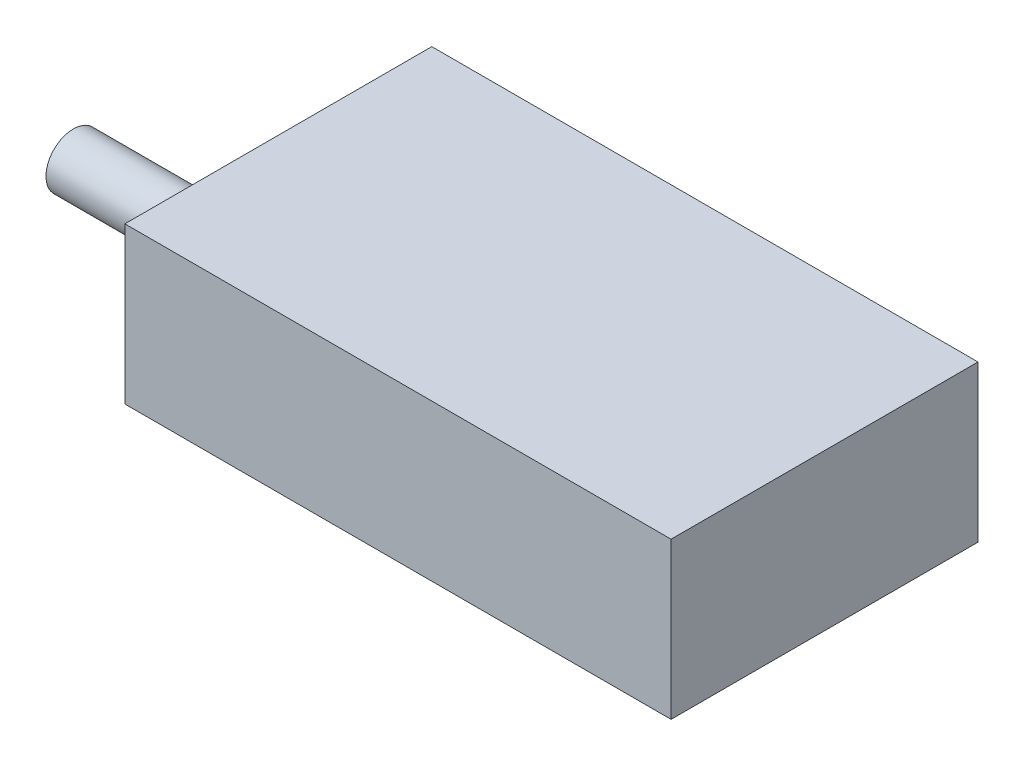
ISO-10303-21;
HEADER;
FILE_DESCRIPTION(('STEP AP214'),'2;1');
FILE_NAME('part.step','',(''),(''),'','','');
FILE_SCHEMA(('AUTOMOTIVE_DESIGN { 1 0 10303 214 1 1 1 1 }'));
ENDSEC;
DATA;
#1=APPLICATION_CONTEXT('core data for automotive mechanical design processes');
#2=APPLICATION_PROTOCOL_DEFINITION('international standard','automotive_design',2000,#1);
#3=PRODUCT_CONTEXT('',#1,'mechanical');
#4=PRODUCT('Part','Part','',(#3));
#5=PRODUCT_RELATED_PRODUCT_CATEGORY('part','',(#4));
#6=PRODUCT_DEFINITION_FORMATION('','',#4);
#7=PRODUCT_DEFINITION_CONTEXT('part definition',#1,'design');
#8=PRODUCT_DEFINITION('design','',#6,#7);
#9=PRODUCT_DEFINITION_SHAPE('','',#8);
#10=(LENGTH_UNIT() NAMED_UNIT(*) SI_UNIT(.MILLI.,.METRE.));
#11=(NAMED_UNIT(*) PLANE_ANGLE_UNIT() SI_UNIT($,.RADIAN.));
#12=(NAMED_UNIT(*) SI_UNIT($,.STERADIAN.) SOLID_ANGLE_UNIT());
#13=UNCERTAINTY_MEASURE_WITH_UNIT(LENGTH_MEASURE(1.E-05),#10,'distance_accuracy_value','');
#14=(GEOMETRIC_REPRESENTATION_CONTEXT(3) GLOBAL_UNCERTAINTY_ASSIGNED_CONTEXT((#13)) GLOBAL_UNIT_ASSIGNED_CONTEXT((#10,
#11,#12)) REPRESENTATION_CONTEXT('',''));
#15=CARTESIAN_POINT('',(0.,0.,0.));
#16=DIRECTION('',(0.,0.,1.));
#17=DIRECTION('',(1.,0.,0.));
#18=AXIS2_PLACEMENT_3D('',#15,#16,#17);
#19=CARTESIAN_POINT('',(-26.8321013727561,30.,-16.5205913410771));
#20=DIRECTION('',(1.,0.,0.));
#21=DIRECTION('',(0.,0.,-1.));
#22=AXIS2_PLACEMENT_3D('',#19,#20,#21);
#23=PLANE('',#22);
#24=CARTESIAN_POINT('',(-26.8321013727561,11.,17.8903033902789));
#25=DIRECTION('',(1.,0.,0.));
#26=DIRECTION('',(0.,0.,-1.));
#27=AXIS2_PLACEMENT_3D('',#24,#25,#26);
#28=CIRCLE('',#27,5.25);
#29=CARTESIAN_POINT('',(-26.8321013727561,11.,12.6403033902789));
#30=VERTEX_POINT('',#29);
#31=EDGE_CURVE('E11',#30,#30,#28,.F.);
#32=ORIENTED_EDGE('',*,*,#31,.F.);
#33=EDGE_LOOP('',(#32));
#34=FACE_BOUND('',#33,.T.);
#35=DIRECTION('',(0.,0.,1.));
#36=VECTOR('',#35,1.);
#37=CARTESIAN_POINT('',(-26.8321013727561,0.,-16.5205913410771));
#38=LINE('',#37,#36);
#39=CARTESIAN_POINT('',(-26.8321013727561,0.,-16.5205913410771));
#40=VERTEX_POINT('',#39);
#41=CARTESIAN_POINT('',(-26.8321013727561,0.,42.4794086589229));
#42=VERTEX_POINT('',#41);
#43=EDGE_CURVE('E99',#40,#42,#38,.T.);
#44=ORIENTED_EDGE('',*,*,#43,.T.);
#45=DIRECTION('',(0.,-1.,0.));
#46=VECTOR('',#45,1.);
#47=CARTESIAN_POINT('',(-26.8321013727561,30.,42.4794086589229));
#48=LINE('',#47,#46);
#49=CARTESIAN_POINT('',(-26.8321013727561,30.,42.4794086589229));
#50=VERTEX_POINT('',#49);
#51=EDGE_CURVE('E41',#50,#42,#48,.T.);
#52=ORIENTED_EDGE('',*,*,#51,.F.);
#53=DIRECTION('',(0.,0.,1.));
#54=VECTOR('',#53,1.);
#55=CARTESIAN_POINT('',(-26.8321013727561,30.,-16.5205913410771));
#56=LINE('',#55,#54);
#57=CARTESIAN_POINT('',(-26.8321013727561,30.,-16.5205913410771));
#58=VERTEX_POINT('',#57);
#59=EDGE_CURVE('E85',#58,#50,#56,.T.);
#60=ORIENTED_EDGE('',*,*,#59,.F.);
#61=DIRECTION('',(0.,-1.,0.));
#62=VECTOR('',#61,1.);
#63=CARTESIAN_POINT('',(-26.8321013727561,30.,-16.5205913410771));
#64=LINE('',#63,#62);
#65=EDGE_CURVE('E95',#58,#40,#64,.T.);
#66=ORIENTED_EDGE('',*,*,#65,.T.);
#67=EDGE_LOOP('',(#44,#52,#60,#66));
#68=FACE_BOUND('',#67,.T.);
#69=ADVANCED_FACE('F33',(#34,#68),#23,.F.);
#70=CARTESIAN_POINT('',(-26.8321013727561,30.,42.4794086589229));
#71=DIRECTION('',(0.,0.,-1.));
#72=DIRECTION('',(-1.,0.,0.));
#73=AXIS2_PLACEMENT_3D('',#70,#71,#72);
#74=PLANE('',#73);
#75=DIRECTION('',(1.,0.,0.));
#76=VECTOR('',#75,1.);
#77=CARTESIAN_POINT('',(-26.8321013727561,0.,42.4794086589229));
#78=LINE('',#77,#76);
#79=CARTESIAN_POINT('',(78.1678986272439,0.,42.4794086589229));
#80=VERTEX_POINT('',#79);
#81=EDGE_CURVE('E90',#42,#80,#78,.T.);
#82=ORIENTED_EDGE('',*,*,#81,.T.);
#83=DIRECTION('',(0.,-1.,0.));
#84=VECTOR('',#83,1.);
#85=CARTESIAN_POINT('',(78.1678986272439,30.,42.4794086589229));
#86=LINE('',#85,#84);
#87=CARTESIAN_POINT('',(78.1678986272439,30.,42.4794086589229));
#88=VERTEX_POINT('',#87);
#89=EDGE_CURVE('E88',#88,#80,#86,.T.);
#90=ORIENTED_EDGE('',*,*,#89,.F.);
#91=DIRECTION('',(1.,0.,0.));
#92=VECTOR('',#91,1.);
#93=CARTESIAN_POINT('',(-26.8321013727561,30.,42.4794086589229));
#94=LINE('',#93,#92);
#95=EDGE_CURVE('E80',#50,#88,#94,.T.);
#96=ORIENTED_EDGE('',*,*,#95,.F.);
#97=ORIENTED_EDGE('',*,*,#51,.T.);
#98=EDGE_LOOP('',(#82,#90,#96,#97));
#99=FACE_BOUND('',#98,.T.);
#100=ADVANCED_FACE('F89',(#99),#74,.F.);
#101=CARTESIAN_POINT('',(78.1678986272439,30.,-16.5205913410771));
#102=DIRECTION('',(-1.,0.,0.));
#103=DIRECTION('',(0.,0.,1.));
#104=AXIS2_PLACEMENT_3D('',#101,#102,#103);
#105=PLANE('',#104);
#106=DIRECTION('',(0.,0.,-1.));
#107=VECTOR('',#106,1.);
#108=CARTESIAN_POINT('',(78.1678986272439,0.,-16.5205913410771));
#109=LINE('',#108,#107);
#110=CARTESIAN_POINT('',(78.1678986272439,0.,-16.5205913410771));
#111=VERTEX_POINT('',#110);
#112=EDGE_CURVE('E66',#80,#111,#109,.T.);
#113=ORIENTED_EDGE('',*,*,#112,.T.);
#114=DIRECTION('',(0.,-1.,0.));
#115=VECTOR('',#114,1.);
#116=CARTESIAN_POINT('',(78.1678986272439,30.,-16.5205913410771));
#117=LINE('',#116,#115);
#118=CARTESIAN_POINT('',(78.1678986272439,30.,-16.5205913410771));
#119=VERTEX_POINT('',#118);
#120=EDGE_CURVE('E91',#119,#111,#117,.T.);
#121=ORIENTED_EDGE('',*,*,#120,.F.);
#122=DIRECTION('',(0.,0.,-1.));
#123=VECTOR('',#122,1.);
#124=CARTESIAN_POINT('',(78.1678986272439,30.,-16.5205913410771));
#125=LINE('',#124,#123);
#126=EDGE_CURVE('E83',#88,#119,#125,.T.);
#127=ORIENTED_EDGE('',*,*,#126,.F.);
#128=ORIENTED_EDGE('',*,*,#89,.T.);
#129=EDGE_LOOP('',(#113,#121,#127,#128));
#130=FACE_BOUND('',#129,.T.);
#131=ADVANCED_FACE('F93',(#130),#105,.F.);
#132=CARTESIAN_POINT('',(-26.8321013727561,30.,-16.5205913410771));
#133=DIRECTION('',(0.,0.,1.));
#134=DIRECTION('',(1.,0.,0.));
#135=AXIS2_PLACEMENT_3D('',#132,#133,#134);
#136=PLANE('',#135);
#137=DIRECTION('',(-1.,0.,0.));
#138=VECTOR('',#137,1.);
#139=CARTESIAN_POINT('',(-26.8321013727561,0.,-16.5205913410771));
#140=LINE('',#139,#138);
#141=EDGE_CURVE('E72',#111,#40,#140,.T.);
#142=ORIENTED_EDGE('',*,*,#141,.T.);
#143=ORIENTED_EDGE('',*,*,#65,.F.);
#144=DIRECTION('',(-1.,0.,0.));
#145=VECTOR('',#144,1.);
#146=CARTESIAN_POINT('',(-26.8321013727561,30.,-16.5205913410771));
#147=LINE('',#146,#145);
#148=EDGE_CURVE('E49',#119,#58,#147,.T.);
#149=ORIENTED_EDGE('',*,*,#148,.F.);
#150=ORIENTED_EDGE('',*,*,#120,.T.);
#151=EDGE_LOOP('',(#142,#143,#149,#150));
#152=FACE_BOUND('',#151,.T.);
#153=ADVANCED_FACE('F121',(#152),#136,.F.);
#154=CARTESIAN_POINT('',(0.,30.,0.));
#155=DIRECTION('',(0.,1.,0.));
#156=DIRECTION('',(0.,0.,1.));
#157=AXIS2_PLACEMENT_3D('',#154,#155,#156);
#158=PLANE('',#157);
#159=ORIENTED_EDGE('',*,*,#59,.T.);
#160=ORIENTED_EDGE('',*,*,#95,.T.);
#161=ORIENTED_EDGE('',*,*,#126,.T.);
#162=ORIENTED_EDGE('',*,*,#148,.T.);
#163=EDGE_LOOP('',(#159,#160,#161,#162));
#164=FACE_BOUND('',#163,.T.);
#165=ADVANCED_FACE('F81',(#164),#158,.T.);
#166=CARTESIAN_POINT('',(0.,0.,0.));
#167=DIRECTION('',(0.,1.,0.));
#168=DIRECTION('',(0.,0.,1.));
#169=AXIS2_PLACEMENT_3D('',#166,#167,#168);
#170=PLANE('',#169);
#171=ORIENTED_EDGE('',*,*,#43,.F.);
#172=ORIENTED_EDGE('',*,*,#141,.F.);
#173=ORIENTED_EDGE('',*,*,#112,.F.);
#174=ORIENTED_EDGE('',*,*,#81,.F.);
#175=EDGE_LOOP('',(#171,#172,#173,#174));
#176=FACE_BOUND('',#175,.T.);
#177=ADVANCED_FACE('F110',(#176),#170,.F.);
#178=CARTESIAN_POINT('',(-61.3321013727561,11.,17.8903033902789));
#179=DIRECTION('',(1.,0.,0.));
#180=DIRECTION('',(0.,0.,-1.));
#181=AXIS2_PLACEMENT_3D('',#178,#179,#180);
#182=CYLINDRICAL_SURFACE('',#181,5.25);
#183=CARTESIAN_POINT('',(-61.3321013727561,11.,17.8903033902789));
#184=DIRECTION('',(-1.,0.,0.));
#185=DIRECTION('',(0.,0.,1.));
#186=AXIS2_PLACEMENT_3D('',#183,#184,#185);
#187=CIRCLE('',#186,5.25);
#188=CARTESIAN_POINT('',(-61.3321013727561,11.,23.1403033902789));
#189=VERTEX_POINT('',#188);
#190=EDGE_CURVE('E102',#189,#189,#187,.T.);
#191=ORIENTED_EDGE('',*,*,#190,.F.);
#192=EDGE_LOOP('',(#191));
#193=FACE_BOUND('',#192,.T.);
#194=ORIENTED_EDGE('',*,*,#31,.T.);
#195=EDGE_LOOP('',(#194));
#196=FACE_BOUND('',#195,.T.);
#197=ADVANCED_FACE('F112',(#193,#196),#182,.T.);
#198=CARTESIAN_POINT('',(-61.3321013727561,11.,17.8903033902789));
#199=DIRECTION('',(-1.,0.,0.));
#200=DIRECTION('',(0.,0.,1.));
#201=AXIS2_PLACEMENT_3D('',#198,#199,#200);
#202=PLANE('',#201);
#203=ORIENTED_EDGE('',*,*,#190,.T.);
#204=EDGE_LOOP('',(#203));
#205=FACE_BOUND('',#204,.T.);
#206=ADVANCED_FACE('F118',(#205),#202,.T.);
#207=CLOSED_SHELL('',(#69,#100,#131,#153,#165,#177,#197,#206));
#208=MANIFOLD_SOLID_BREP('B2',#207);
#209=ADVANCED_BREP_SHAPE_REPRESENTATION('',(#18,#208),#14);
#210=SHAPE_DEFINITION_REPRESENTATION(#9,#209);
ENDSEC;
END-ISO-10303-21;
